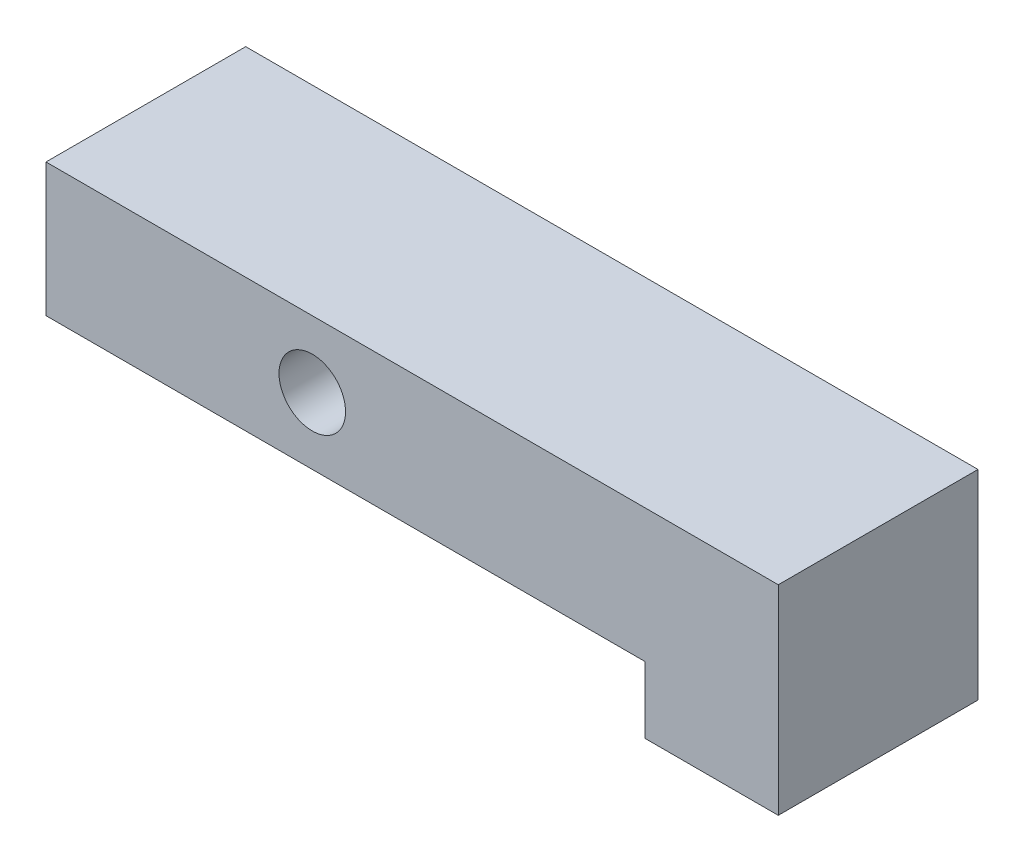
ISO-10303-21;
HEADER;
FILE_DESCRIPTION(('STEP AP214'),'2;1');
FILE_NAME('part.step','',(''),(''),'','','');
FILE_SCHEMA(('AUTOMOTIVE_DESIGN { 1 0 10303 214 1 1 1 1 }'));
ENDSEC;
DATA;
#1=APPLICATION_CONTEXT('core data for automotive mechanical design processes');
#2=APPLICATION_PROTOCOL_DEFINITION('international standard','automotive_design',2000,#1);
#3=PRODUCT_CONTEXT('',#1,'mechanical');
#4=PRODUCT('Part','Part','',(#3));
#5=PRODUCT_RELATED_PRODUCT_CATEGORY('part','',(#4));
#6=PRODUCT_DEFINITION_FORMATION('','',#4);
#7=PRODUCT_DEFINITION_CONTEXT('part definition',#1,'design');
#8=PRODUCT_DEFINITION('design','',#6,#7);
#9=PRODUCT_DEFINITION_SHAPE('','',#8);
#10=(LENGTH_UNIT() NAMED_UNIT(*) SI_UNIT(.MILLI.,.METRE.));
#11=(NAMED_UNIT(*) PLANE_ANGLE_UNIT() SI_UNIT($,.RADIAN.));
#12=(NAMED_UNIT(*) SI_UNIT($,.STERADIAN.) SOLID_ANGLE_UNIT());
#13=UNCERTAINTY_MEASURE_WITH_UNIT(LENGTH_MEASURE(1.E-05),#10,'distance_accuracy_value','');
#14=(GEOMETRIC_REPRESENTATION_CONTEXT(3) GLOBAL_UNCERTAINTY_ASSIGNED_CONTEXT((#13)) GLOBAL_UNIT_ASSIGNED_CONTEXT((#10,
#11,#12)) REPRESENTATION_CONTEXT('',''));
#15=CARTESIAN_POINT('',(0.,0.,0.));
#16=DIRECTION('',(0.,0.,1.));
#17=DIRECTION('',(1.,0.,0.));
#18=AXIS2_PLACEMENT_3D('',#15,#16,#17);
#19=CARTESIAN_POINT('',(44.45,-58.8892472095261,19.05));
#20=DIRECTION('',(1.,0.,0.));
#21=DIRECTION('',(0.,1.,0.));
#22=AXIS2_PLACEMENT_3D('',#19,#20,#21);
#23=PLANE('',#22);
#24=DIRECTION('',(0.,-1.,0.));
#25=VECTOR('',#24,1.);
#26=CARTESIAN_POINT('',(44.45,-58.8892472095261,0.));
#27=LINE('',#26,#25);
#28=CARTESIAN_POINT('',(44.45,6.34999999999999,0.));
#29=VERTEX_POINT('',#28);
#30=CARTESIAN_POINT('',(44.45,-12.7,0.));
#31=VERTEX_POINT('',#30);
#32=EDGE_CURVE('E121',#29,#31,#27,.T.);
#33=ORIENTED_EDGE('',*,*,#32,.F.);
#34=DIRECTION('',(0.,0.,-1.));
#35=VECTOR('',#34,1.);
#36=CARTESIAN_POINT('',(44.45,6.34999999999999,19.05));
#37=LINE('',#36,#35);
#38=CARTESIAN_POINT('',(44.45,6.34999999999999,19.05));
#39=VERTEX_POINT('',#38);
#40=EDGE_CURVE('E11',#39,#29,#37,.T.);
#41=ORIENTED_EDGE('',*,*,#40,.F.);
#42=DIRECTION('',(0.,-1.,0.));
#43=VECTOR('',#42,1.);
#44=CARTESIAN_POINT('',(44.45,-58.8892472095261,19.05));
#45=LINE('',#44,#43);
#46=CARTESIAN_POINT('',(44.45,-12.7,19.05));
#47=VERTEX_POINT('',#46);
#48=EDGE_CURVE('E136',#39,#47,#45,.T.);
#49=ORIENTED_EDGE('',*,*,#48,.T.);
#50=DIRECTION('',(0.,0.,-1.));
#51=VECTOR('',#50,1.);
#52=CARTESIAN_POINT('',(44.45,-12.7,19.05));
#53=LINE('',#52,#51);
#54=EDGE_CURVE('E51',#47,#31,#53,.T.);
#55=ORIENTED_EDGE('',*,*,#54,.T.);
#56=EDGE_LOOP('',(#33,#41,#49,#55));
#57=FACE_BOUND('',#56,.T.);
#58=ADVANCED_FACE('F35',(#57),#23,.T.);
#59=CARTESIAN_POINT('',(11.3956725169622,6.34999999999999,19.05));
#60=DIRECTION('',(0.,-1.,0.));
#61=DIRECTION('',(1.,0.,0.));
#62=AXIS2_PLACEMENT_3D('',#59,#60,#61);
#63=PLANE('',#62);
#64=DIRECTION('',(-1.,0.,0.));
#65=VECTOR('',#64,1.);
#66=CARTESIAN_POINT('',(11.3956725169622,6.34999999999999,0.));
#67=LINE('',#66,#65);
#68=CARTESIAN_POINT('',(-25.4,6.34999999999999,0.));
#69=VERTEX_POINT('',#68);
#70=EDGE_CURVE('E123',#29,#69,#67,.T.);
#71=ORIENTED_EDGE('',*,*,#70,.T.);
#72=DIRECTION('',(0.,0.,-1.));
#73=VECTOR('',#72,1.);
#74=CARTESIAN_POINT('',(-25.4,6.34999999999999,19.05));
#75=LINE('',#74,#73);
#76=CARTESIAN_POINT('',(-25.4,6.34999999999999,19.05));
#77=VERTEX_POINT('',#76);
#78=EDGE_CURVE('E43',#77,#69,#75,.T.);
#79=ORIENTED_EDGE('',*,*,#78,.F.);
#80=DIRECTION('',(-1.,0.,0.));
#81=VECTOR('',#80,1.);
#82=CARTESIAN_POINT('',(11.3956725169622,6.34999999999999,19.05));
#83=LINE('',#82,#81);
#84=EDGE_CURVE('E235',#39,#77,#83,.T.);
#85=ORIENTED_EDGE('',*,*,#84,.F.);
#86=ORIENTED_EDGE('',*,*,#40,.T.);
#87=EDGE_LOOP('',(#71,#79,#85,#86));
#88=FACE_BOUND('',#87,.T.);
#89=ADVANCED_FACE('F161',(#88),#63,.F.);
#90=CARTESIAN_POINT('',(-25.4,-58.8892472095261,19.05));
#91=DIRECTION('',(1.,0.,0.));
#92=DIRECTION('',(0.,0.,-1.));
#93=AXIS2_PLACEMENT_3D('',#90,#91,#92);
#94=PLANE('',#93);
#95=DIRECTION('',(0.,-1.,0.));
#96=VECTOR('',#95,1.);
#97=CARTESIAN_POINT('',(-25.4,-58.8892472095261,0.));
#98=LINE('',#97,#96);
#99=CARTESIAN_POINT('',(-25.4,-6.35,0.));
#100=VERTEX_POINT('',#99);
#101=EDGE_CURVE('E125',#69,#100,#98,.T.);
#102=ORIENTED_EDGE('',*,*,#101,.T.);
#103=DIRECTION('',(0.,0.,-1.));
#104=VECTOR('',#103,1.);
#105=CARTESIAN_POINT('',(-25.4,-6.35,19.05));
#106=LINE('',#105,#104);
#107=CARTESIAN_POINT('',(-25.4,-6.35,19.05));
#108=VERTEX_POINT('',#107);
#109=EDGE_CURVE('E110',#108,#100,#106,.T.);
#110=ORIENTED_EDGE('',*,*,#109,.F.);
#111=DIRECTION('',(0.,-1.,0.));
#112=VECTOR('',#111,1.);
#113=CARTESIAN_POINT('',(-25.4,-58.8892472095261,19.05));
#114=LINE('',#113,#112);
#115=EDGE_CURVE('E98',#77,#108,#114,.T.);
#116=ORIENTED_EDGE('',*,*,#115,.F.);
#117=ORIENTED_EDGE('',*,*,#78,.T.);
#118=EDGE_LOOP('',(#102,#110,#116,#117));
#119=FACE_BOUND('',#118,.T.);
#120=ADVANCED_FACE('F143',(#119),#94,.F.);
#121=CARTESIAN_POINT('',(11.3956725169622,-6.35,19.05));
#122=DIRECTION('',(0.,1.,0.));
#123=DIRECTION('',(-1.,0.,0.));
#124=AXIS2_PLACEMENT_3D('',#121,#122,#123);
#125=PLANE('',#124);
#126=DIRECTION('',(1.,0.,0.));
#127=VECTOR('',#126,1.);
#128=CARTESIAN_POINT('',(11.3956725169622,-6.35,0.));
#129=LINE('',#128,#127);
#130=CARTESIAN_POINT('',(31.75,-6.35,0.));
#131=VERTEX_POINT('',#130);
#132=EDGE_CURVE('E107',#100,#131,#129,.T.);
#133=ORIENTED_EDGE('',*,*,#132,.T.);
#134=DIRECTION('',(0.,0.,-1.));
#135=VECTOR('',#134,1.);
#136=CARTESIAN_POINT('',(31.75,-6.35,19.05));
#137=LINE('',#136,#135);
#138=CARTESIAN_POINT('',(31.75,-6.35,19.05));
#139=VERTEX_POINT('',#138);
#140=EDGE_CURVE('E104',#139,#131,#137,.T.);
#141=ORIENTED_EDGE('',*,*,#140,.F.);
#142=DIRECTION('',(1.,0.,0.));
#143=VECTOR('',#142,1.);
#144=CARTESIAN_POINT('',(11.3956725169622,-6.35,19.05));
#145=LINE('',#144,#143);
#146=EDGE_CURVE('E89',#108,#139,#145,.T.);
#147=ORIENTED_EDGE('',*,*,#146,.F.);
#148=ORIENTED_EDGE('',*,*,#109,.T.);
#149=EDGE_LOOP('',(#133,#141,#147,#148));
#150=FACE_BOUND('',#149,.T.);
#151=ADVANCED_FACE('F105',(#150),#125,.F.);
#152=CARTESIAN_POINT('',(31.75,-58.8892472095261,19.05));
#153=DIRECTION('',(-1.,0.,0.));
#154=DIRECTION('',(0.,0.,1.));
#155=AXIS2_PLACEMENT_3D('',#152,#153,#154);
#156=PLANE('',#155);
#157=DIRECTION('',(0.,1.,0.));
#158=VECTOR('',#157,1.);
#159=CARTESIAN_POINT('',(31.75,-58.8892472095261,0.));
#160=LINE('',#159,#158);
#161=CARTESIAN_POINT('',(31.75,-12.7,0.));
#162=VERTEX_POINT('',#161);
#163=EDGE_CURVE('E128',#162,#131,#160,.T.);
#164=ORIENTED_EDGE('',*,*,#163,.F.);
#165=DIRECTION('',(0.,0.,-1.));
#166=VECTOR('',#165,1.);
#167=CARTESIAN_POINT('',(31.75,-12.7,19.05));
#168=LINE('',#167,#166);
#169=CARTESIAN_POINT('',(31.75,-12.7,19.05));
#170=VERTEX_POINT('',#169);
#171=EDGE_CURVE('E70',#170,#162,#168,.T.);
#172=ORIENTED_EDGE('',*,*,#171,.F.);
#173=DIRECTION('',(0.,1.,0.));
#174=VECTOR('',#173,1.);
#175=CARTESIAN_POINT('',(31.75,-58.8892472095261,19.05));
#176=LINE('',#175,#174);
#177=EDGE_CURVE('E96',#170,#139,#176,.T.);
#178=ORIENTED_EDGE('',*,*,#177,.T.);
#179=ORIENTED_EDGE('',*,*,#140,.T.);
#180=EDGE_LOOP('',(#164,#172,#178,#179));
#181=FACE_BOUND('',#180,.T.);
#182=ADVANCED_FACE('F112',(#181),#156,.T.);
#183=CARTESIAN_POINT('',(11.3956725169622,-12.7,19.05));
#184=DIRECTION('',(0.,-1.,0.));
#185=DIRECTION('',(1.,0.,0.));
#186=AXIS2_PLACEMENT_3D('',#183,#184,#185);
#187=PLANE('',#186);
#188=DIRECTION('',(-1.,0.,0.));
#189=VECTOR('',#188,1.);
#190=CARTESIAN_POINT('',(11.3956725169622,-12.7,0.));
#191=LINE('',#190,#189);
#192=EDGE_CURVE('E130',#31,#162,#191,.T.);
#193=ORIENTED_EDGE('',*,*,#192,.F.);
#194=ORIENTED_EDGE('',*,*,#54,.F.);
#195=DIRECTION('',(-1.,0.,0.));
#196=VECTOR('',#195,1.);
#197=CARTESIAN_POINT('',(11.3956725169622,-12.7,19.05));
#198=LINE('',#197,#196);
#199=EDGE_CURVE('E113',#47,#170,#198,.T.);
#200=ORIENTED_EDGE('',*,*,#199,.T.);
#201=ORIENTED_EDGE('',*,*,#171,.T.);
#202=EDGE_LOOP('',(#193,#194,#200,#201));
#203=FACE_BOUND('',#202,.T.);
#204=ADVANCED_FACE('F149',(#203),#187,.T.);
#205=CARTESIAN_POINT('',(0.,0.,19.05));
#206=DIRECTION('',(0.,0.,-1.));
#207=DIRECTION('',(-1.,0.,0.));
#208=AXIS2_PLACEMENT_3D('',#205,#206,#207);
#209=CYLINDRICAL_SURFACE('',#208,3.175);
#210=CARTESIAN_POINT('',(0.,0.,19.05));
#211=DIRECTION('',(0.,0.,1.));
#212=DIRECTION('',(1.,0.,0.));
#213=AXIS2_PLACEMENT_3D('',#210,#211,#212);
#214=CIRCLE('',#213,3.175);
#215=CARTESIAN_POINT('',(-3.175,0.,19.05));
#216=VERTEX_POINT('',#215);
#217=EDGE_CURVE('E115',#216,#216,#214,.T.);
#218=CARTESIAN_POINT('',(0.,0.,0.));
#219=DIRECTION('',(0.,0.,1.));
#220=DIRECTION('',(1.,0.,0.));
#221=AXIS2_PLACEMENT_3D('',#218,#219,#220);
#222=CIRCLE('',#221,3.175);
#223=CARTESIAN_POINT('',(-3.175,0.,0.));
#224=VERTEX_POINT('',#223);
#225=EDGE_CURVE('E133',#224,#224,#222,.T.);
#226=CARTESIAN_POINT('',(-3.175,0.,19.05));
#227=CARTESIAN_POINT('',(-3.175,0.,18.8515625));
#228=CARTESIAN_POINT('',(-3.175,0.,18.653125));
#229=CARTESIAN_POINT('',(-3.175,0.,18.25625));
#230=CARTESIAN_POINT('',(-3.175,0.,18.0578125));
#231=CARTESIAN_POINT('',(-3.175,0.,17.6609375));
#232=CARTESIAN_POINT('',(-3.175,0.,17.4625));
#233=CARTESIAN_POINT('',(-3.175,0.,17.065625));
#234=CARTESIAN_POINT('',(-3.175,0.,16.8671875));
#235=CARTESIAN_POINT('',(-3.175,0.,16.4703125));
#236=CARTESIAN_POINT('',(-3.175,0.,16.271875));
#237=CARTESIAN_POINT('',(-3.175,0.,15.875));
#238=CARTESIAN_POINT('',(-3.175,0.,15.6765625));
#239=CARTESIAN_POINT('',(-3.175,0.,15.2796875));
#240=CARTESIAN_POINT('',(-3.175,0.,15.08125));
#241=CARTESIAN_POINT('',(-3.175,0.,14.684375));
#242=CARTESIAN_POINT('',(-3.175,0.,14.4859375));
#243=CARTESIAN_POINT('',(-3.175,0.,14.0890625));
#244=CARTESIAN_POINT('',(-3.175,0.,13.890625));
#245=CARTESIAN_POINT('',(-3.175,0.,13.49375));
#246=CARTESIAN_POINT('',(-3.175,0.,13.2953125));
#247=CARTESIAN_POINT('',(-3.175,0.,12.8984375));
#248=CARTESIAN_POINT('',(-3.175,0.,12.7));
#249=CARTESIAN_POINT('',(-3.175,0.,12.303125));
#250=CARTESIAN_POINT('',(-3.175,0.,12.1046875));
#251=CARTESIAN_POINT('',(-3.175,0.,11.7078125));
#252=CARTESIAN_POINT('',(-3.175,0.,11.509375));
#253=CARTESIAN_POINT('',(-3.175,0.,11.1125));
#254=CARTESIAN_POINT('',(-3.175,0.,10.9140625));
#255=CARTESIAN_POINT('',(-3.175,0.,10.5171875));
#256=CARTESIAN_POINT('',(-3.175,0.,10.31875));
#257=CARTESIAN_POINT('',(-3.175,0.,9.921875));
#258=CARTESIAN_POINT('',(-3.175,0.,9.7234375));
#259=CARTESIAN_POINT('',(-3.175,0.,9.3265625));
#260=CARTESIAN_POINT('',(-3.175,0.,9.128125));
#261=CARTESIAN_POINT('',(-3.175,0.,8.73125));
#262=CARTESIAN_POINT('',(-3.175,0.,8.5328125));
#263=CARTESIAN_POINT('',(-3.175,0.,8.1359375));
#264=CARTESIAN_POINT('',(-3.175,0.,7.9375));
#265=CARTESIAN_POINT('',(-3.175,0.,7.540625));
#266=CARTESIAN_POINT('',(-3.175,0.,7.3421875));
#267=CARTESIAN_POINT('',(-3.175,0.,6.9453125));
#268=CARTESIAN_POINT('',(-3.175,0.,6.746875));
#269=CARTESIAN_POINT('',(-3.175,0.,6.35));
#270=CARTESIAN_POINT('',(-3.175,0.,6.1515625));
#271=CARTESIAN_POINT('',(-3.175,0.,5.7546875));
#272=CARTESIAN_POINT('',(-3.175,0.,5.55625));
#273=CARTESIAN_POINT('',(-3.175,0.,5.159375));
#274=CARTESIAN_POINT('',(-3.175,0.,4.9609375));
#275=CARTESIAN_POINT('',(-3.175,0.,4.5640625));
#276=CARTESIAN_POINT('',(-3.175,0.,4.365625));
#277=CARTESIAN_POINT('',(-3.175,0.,3.96875));
#278=CARTESIAN_POINT('',(-3.175,0.,3.7703125));
#279=CARTESIAN_POINT('',(-3.175,0.,3.3734375));
#280=CARTESIAN_POINT('',(-3.175,0.,3.175));
#281=CARTESIAN_POINT('',(-3.175,0.,2.778125));
#282=CARTESIAN_POINT('',(-3.175,0.,2.5796875));
#283=CARTESIAN_POINT('',(-3.175,0.,2.1828125));
#284=CARTESIAN_POINT('',(-3.175,0.,1.984375));
#285=CARTESIAN_POINT('',(-3.175,0.,1.5875));
#286=CARTESIAN_POINT('',(-3.175,0.,1.3890625));
#287=CARTESIAN_POINT('',(-3.175,0.,0.992187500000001));
#288=CARTESIAN_POINT('',(-3.175,0.,0.793750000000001));
#289=CARTESIAN_POINT('',(-3.175,0.,0.396875));
#290=CARTESIAN_POINT('',(-3.175,0.,0.1984375));
#291=CARTESIAN_POINT('',(-3.175,0.,0.));
#292=B_SPLINE_CURVE_WITH_KNOTS('',3,(#226,#227,#228,#229,#230,#231,#232,#233,#234,#235,#236,
#237,#238,#239,#240,#241,#242,#243,#244,#245,#246,#247,#248,#249,#250,#251,#252,#253,#254,#255,
#256,#257,#258,#259,#260,#261,#262,#263,#264,#265,#266,#267,#268,#269,#270,#271,#272,#273,#274,
#275,#276,#277,#278,#279,#280,#281,#282,#283,#284,#285,#286,#287,#288,#289,#290,#291),
.UNSPECIFIED.,.F.,.F.,(4,2,2,2,2,2,2,2,2,2,2,2,2,2,2,2,2,2,2,2,2,2,2,2,2,2,2,2,2,2,2,2,4),(0.,
0.595312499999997,1.190625,1.7859375,2.38125,2.9765625,3.571875,4.1671875,4.7625,5.3578125,
5.953125,6.5484375,7.14375,7.7390625,8.334375,8.9296875,9.525,10.1203125,10.715625,11.3109375,
11.90625,12.5015625,13.096875,13.6921875,14.2875,14.8828125,15.478125,16.0734375,16.66875,
17.2640625,17.859375,18.4546875,19.05),.UNSPECIFIED.);
#293=EDGE_CURVE('BSEAM151',#216,#224,#292,.T.);
#294=ORIENTED_EDGE('',*,*,#217,.T.);
#295=ORIENTED_EDGE('',*,*,#225,.F.);
#296=ORIENTED_EDGE('',*,*,#293,.T.);
#297=ORIENTED_EDGE('',*,*,#293,.F.);
#298=EDGE_LOOP('',(#294,#296,#295,#297));
#299=FACE_BOUND('',#298,.T.);
#300=ADVANCED_FACE('F151',(#299),#209,.F.);
#301=CARTESIAN_POINT('',(11.3956725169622,-58.8892472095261,19.05));
#302=DIRECTION('',(0.,0.,1.));
#303=DIRECTION('',(1.,0.,0.));
#304=AXIS2_PLACEMENT_3D('',#301,#302,#303);
#305=PLANE('',#304);
#306=ORIENTED_EDGE('',*,*,#48,.F.);
#307=ORIENTED_EDGE('',*,*,#84,.T.);
#308=ORIENTED_EDGE('',*,*,#115,.T.);
#309=ORIENTED_EDGE('',*,*,#146,.T.);
#310=ORIENTED_EDGE('',*,*,#177,.F.);
#311=ORIENTED_EDGE('',*,*,#199,.F.);
#312=EDGE_LOOP('',(#306,#307,#308,#309,#310,#311));
#313=FACE_BOUND('',#312,.T.);
#314=ORIENTED_EDGE('',*,*,#217,.F.);
#315=EDGE_LOOP('',(#314));
#316=FACE_BOUND('',#315,.T.);
#317=ADVANCED_FACE('F92',(#313,#316),#305,.T.);
#318=CARTESIAN_POINT('',(11.3956725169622,-58.8892472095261,0.));
#319=DIRECTION('',(0.,0.,1.));
#320=DIRECTION('',(1.,0.,0.));
#321=AXIS2_PLACEMENT_3D('',#318,#319,#320);
#322=PLANE('',#321);
#323=ORIENTED_EDGE('',*,*,#32,.T.);
#324=ORIENTED_EDGE('',*,*,#192,.T.);
#325=ORIENTED_EDGE('',*,*,#163,.T.);
#326=ORIENTED_EDGE('',*,*,#132,.F.);
#327=ORIENTED_EDGE('',*,*,#101,.F.);
#328=ORIENTED_EDGE('',*,*,#70,.F.);
#329=EDGE_LOOP('',(#323,#324,#325,#326,#327,#328));
#330=FACE_BOUND('',#329,.T.);
#331=ORIENTED_EDGE('',*,*,#225,.T.);
#332=EDGE_LOOP('',(#331));
#333=FACE_BOUND('',#332,.T.);
#334=ADVANCED_FACE('F147',(#330,#333),#322,.F.);
#335=CLOSED_SHELL('',(#58,#89,#120,#151,#182,#204,#300,#317,#334));
#336=MANIFOLD_SOLID_BREP('B2',#335);
#337=ADVANCED_BREP_SHAPE_REPRESENTATION('',(#18,#336),#14);
#338=SHAPE_DEFINITION_REPRESENTATION(#9,#337);
ENDSEC;
END-ISO-10303-21;
